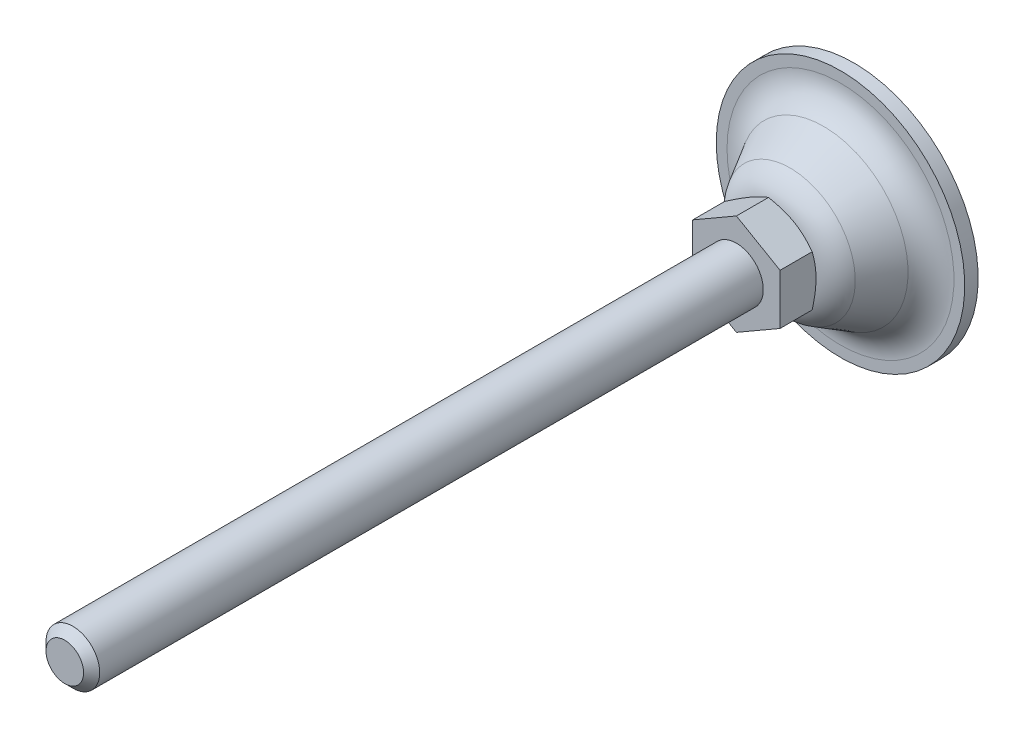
ISO-10303-21;
HEADER;
FILE_DESCRIPTION(('STEP AP214'),'2;1');
FILE_NAME('part.step','',(''),(''),'','','');
FILE_SCHEMA(('AUTOMOTIVE_DESIGN { 1 0 10303 214 1 1 1 1 }'));
ENDSEC;
DATA;
#1=APPLICATION_CONTEXT('core data for automotive mechanical design processes');
#2=APPLICATION_PROTOCOL_DEFINITION('international standard','automotive_design',2000,#1);
#3=PRODUCT_CONTEXT('',#1,'mechanical');
#4=PRODUCT('Part','Part','',(#3));
#5=PRODUCT_RELATED_PRODUCT_CATEGORY('part','',(#4));
#6=PRODUCT_DEFINITION_FORMATION('','',#4);
#7=PRODUCT_DEFINITION_CONTEXT('part definition',#1,'design');
#8=PRODUCT_DEFINITION('design','',#6,#7);
#9=PRODUCT_DEFINITION_SHAPE('','',#8);
#10=(LENGTH_UNIT() NAMED_UNIT(*) SI_UNIT(.MILLI.,.METRE.));
#11=(NAMED_UNIT(*) PLANE_ANGLE_UNIT() SI_UNIT($,.RADIAN.));
#12=(NAMED_UNIT(*) SI_UNIT($,.STERADIAN.) SOLID_ANGLE_UNIT());
#13=UNCERTAINTY_MEASURE_WITH_UNIT(LENGTH_MEASURE(1.E-05),#10,'distance_accuracy_value','');
#14=(GEOMETRIC_REPRESENTATION_CONTEXT(3) GLOBAL_UNCERTAINTY_ASSIGNED_CONTEXT((#13)) GLOBAL_UNIT_ASSIGNED_CONTEXT((#10,
#11,#12)) REPRESENTATION_CONTEXT('',''));
#15=CARTESIAN_POINT('',(0.,0.,0.));
#16=DIRECTION('',(0.,0.,1.));
#17=DIRECTION('',(1.,0.,0.));
#18=AXIS2_PLACEMENT_3D('',#15,#16,#17);
#19=CARTESIAN_POINT('',(-9.25,16.0214699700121,1.9999991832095));
#20=DIRECTION('',(0.,0.,-1.));
#21=DIRECTION('',(-0.5,0.86602540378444,0.));
#22=AXIS2_PLACEMENT_3D('',#19,#20,#21);
#23=PLANE('',#22);
#24=CARTESIAN_POINT('',(0.,0.,1.9999991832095));
#25=DIRECTION('',(0.,0.,1.));
#26=DIRECTION('',(0.5,-0.86602540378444,0.));
#27=AXIS2_PLACEMENT_3D('',#24,#25,#26);
#28=CIRCLE('',#27,16.8976413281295);
#29=CARTESIAN_POINT('',(8.44882066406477,-14.633786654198,1.9999991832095));
#30=VERTEX_POINT('',#29);
#31=EDGE_CURVE('E108',#30,#30,#28,.T.);
#32=ORIENTED_EDGE('',*,*,#31,.F.);
#33=EDGE_LOOP('',(#32));
#34=FACE_BOUND('',#33,.T.);
#35=CARTESIAN_POINT('',(0.,0.,2.));
#36=DIRECTION('',(0.,0.,-1.));
#37=DIRECTION('',(-1.,0.,0.));
#38=AXIS2_PLACEMENT_3D('',#35,#36,#37);
#39=CIRCLE('',#38,18.5);
#40=CARTESIAN_POINT('',(-18.5,0.,2.));
#41=VERTEX_POINT('',#40);
#42=EDGE_CURVE('E207',#41,#41,#39,.T.);
#43=ORIENTED_EDGE('',*,*,#42,.F.);
#44=EDGE_LOOP('',(#43));
#45=FACE_BOUND('',#44,.T.);
#46=ADVANCED_FACE('F14',(#34,#45),#23,.F.);
#47=CARTESIAN_POINT('',(0.,0.,17.5));
#48=DIRECTION('',(0.,0.,1.));
#49=DIRECTION('',(0.5,-0.86602540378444,0.));
#50=AXIS2_PLACEMENT_3D('',#47,#48,#49);
#51=PLANE('',#50);
#52=DIRECTION('',(0.,1.,0.));
#53=VECTOR('',#52,1.);
#54=CARTESIAN_POINT('',(6.5,-3.75277674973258,17.5));
#55=LINE('',#54,#53);
#56=CARTESIAN_POINT('',(6.5,-3.75277674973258,17.5));
#57=VERTEX_POINT('',#56);
#58=CARTESIAN_POINT('',(6.5,3.75277674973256,17.5));
#59=VERTEX_POINT('',#58);
#60=EDGE_CURVE('E371',#57,#59,#55,.T.);
#61=ORIENTED_EDGE('',*,*,#60,.T.);
#62=DIRECTION('',(-0.866025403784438,0.5,0.));
#63=VECTOR('',#62,1.);
#64=CARTESIAN_POINT('',(6.5,3.75277674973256,17.5));
#65=LINE('',#64,#63);
#66=CARTESIAN_POINT('',(0.,7.50555349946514,17.5));
#67=VERTEX_POINT('',#66);
#68=EDGE_CURVE('E368',#59,#67,#65,.T.);
#69=ORIENTED_EDGE('',*,*,#68,.T.);
#70=DIRECTION('',(-0.866025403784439,-0.5,0.));
#71=VECTOR('',#70,1.);
#72=CARTESIAN_POINT('',(0.,7.50555349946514,17.5));
#73=LINE('',#72,#71);
#74=CARTESIAN_POINT('',(-6.5,3.75277674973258,17.5));
#75=VERTEX_POINT('',#74);
#76=EDGE_CURVE('E367',#67,#75,#73,.T.);
#77=ORIENTED_EDGE('',*,*,#76,.T.);
#78=DIRECTION('',(0.,-1.,0.));
#79=VECTOR('',#78,1.);
#80=CARTESIAN_POINT('',(-6.5,3.75277674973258,17.5));
#81=LINE('',#80,#79);
#82=CARTESIAN_POINT('',(-6.5,-3.75277674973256,17.5));
#83=VERTEX_POINT('',#82);
#84=EDGE_CURVE('E375',#75,#83,#81,.T.);
#85=ORIENTED_EDGE('',*,*,#84,.T.);
#86=DIRECTION('',(0.866025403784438,-0.5,0.));
#87=VECTOR('',#86,1.);
#88=CARTESIAN_POINT('',(-6.5,-3.75277674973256,17.5));
#89=LINE('',#88,#87);
#90=CARTESIAN_POINT('',(0.,-7.50555349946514,17.5));
#91=VERTEX_POINT('',#90);
#92=EDGE_CURVE('E377',#83,#91,#89,.T.);
#93=ORIENTED_EDGE('',*,*,#92,.T.);
#94=DIRECTION('',(0.866025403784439,0.5,0.));
#95=VECTOR('',#94,1.);
#96=CARTESIAN_POINT('',(0.,-7.50555349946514,17.5));
#97=LINE('',#96,#95);
#98=EDGE_CURVE('E37',#91,#57,#97,.T.);
#99=ORIENTED_EDGE('',*,*,#98,.T.);
#100=EDGE_LOOP('',(#61,#69,#77,#85,#93,#99));
#101=FACE_BOUND('',#100,.T.);
#102=CARTESIAN_POINT('',(0.,0.,17.5));
#103=DIRECTION('',(0.,0.,1.));
#104=DIRECTION('',(0.5,-0.86602540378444,0.));
#105=AXIS2_PLACEMENT_3D('',#102,#103,#104);
#106=CIRCLE('',#105,4.);
#107=CARTESIAN_POINT('',(2.,-3.46410161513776,17.5));
#108=VERTEX_POINT('',#107);
#109=EDGE_CURVE('E212',#108,#108,#106,.T.);
#110=ORIENTED_EDGE('',*,*,#109,.F.);
#111=EDGE_LOOP('',(#110));
#112=FACE_BOUND('',#111,.T.);
#113=ADVANCED_FACE('F129',(#101,#112),#51,.T.);
#114=CARTESIAN_POINT('',(0.,0.,7.));
#115=DIRECTION('',(0.,0.,1.));
#116=DIRECTION('',(0.5,-0.86602540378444,0.));
#117=AXIS2_PLACEMENT_3D('',#114,#115,#116);
#118=TOROIDAL_SURFACE('',#117,5.36011171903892,5.);
#119=CARTESIAN_POINT('',(0.,0.,12.));
#120=DIRECTION('',(0.,0.,1.));
#121=DIRECTION('',(0.5,-0.86602540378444,0.));
#122=AXIS2_PLACEMENT_3D('',#119,#120,#121);
#123=CIRCLE('',#122,5.36011171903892);
#124=CARTESIAN_POINT('',(2.68005585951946,-4.64199291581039,12.));
#125=VERTEX_POINT('',#124);
#126=EDGE_CURVE('E73',#125,#125,#123,.T.);
#127=ORIENTED_EDGE('',*,*,#126,.F.);
#128=EDGE_LOOP('',(#127));
#129=FACE_BOUND('',#128,.T.);
#130=CARTESIAN_POINT('',(0.,0.,9.49382979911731));
#131=DIRECTION('',(0.,0.,1.));
#132=DIRECTION('',(0.5,-0.86602540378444,0.));
#133=AXIS2_PLACEMENT_3D('',#130,#131,#132);
#134=CIRCLE('',#133,9.69379524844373);
#135=CARTESIAN_POINT('',(4.84689762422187,-8.39507294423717,9.49382979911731));
#136=VERTEX_POINT('',#135);
#137=EDGE_CURVE('E102',#136,#136,#134,.T.);
#138=ORIENTED_EDGE('',*,*,#137,.T.);
#139=EDGE_LOOP('',(#138));
#140=FACE_BOUND('',#139,.T.);
#141=ADVANCED_FACE('F186',(#129,#140),#118,.T.);
#142=CARTESIAN_POINT('',(0.,0.,6.9999991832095));
#143=DIRECTION('',(0.,0.,1.));
#144=DIRECTION('',(0.5,-0.86602540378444,0.));
#145=AXIS2_PLACEMENT_3D('',#142,#143,#144);
#146=TOROIDAL_SURFACE('',#145,16.8976413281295,5.);
#147=CARTESIAN_POINT('',(0.,0.,4.50616938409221));
#148=DIRECTION('',(0.,0.,1.));
#149=DIRECTION('',(0.5,-0.86602540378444,0.));
#150=AXIS2_PLACEMENT_3D('',#147,#148,#149);
#151=CIRCLE('',#150,12.5639577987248);
#152=CARTESIAN_POINT('',(6.28197889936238,-10.8807066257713,4.50616938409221));
#153=VERTEX_POINT('',#152);
#154=EDGE_CURVE('E105',#153,#153,#151,.T.);
#155=ORIENTED_EDGE('',*,*,#154,.F.);
#156=EDGE_LOOP('',(#155));
#157=FACE_BOUND('',#156,.T.);
#158=ORIENTED_EDGE('',*,*,#31,.T.);
#159=EDGE_LOOP('',(#158));
#160=FACE_BOUND('',#159,.T.);
#161=ADVANCED_FACE('F182',(#157,#160),#146,.F.);
#162=CARTESIAN_POINT('',(0.,0.,4.50616938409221));
#163=DIRECTION('',(0.,0.,-1.));
#164=DIRECTION('',(-0.5,0.86602540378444,0.));
#165=AXIS2_PLACEMENT_3D('',#162,#163,#164);
#166=CONICAL_SURFACE('',#165,12.5639577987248,0.522174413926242);
#167=ORIENTED_EDGE('',*,*,#137,.F.);
#168=EDGE_LOOP('',(#167));
#169=FACE_BOUND('',#168,.T.);
#170=ORIENTED_EDGE('',*,*,#154,.T.);
#171=EDGE_LOOP('',(#170));
#172=FACE_BOUND('',#171,.T.);
#173=ADVANCED_FACE('F179',(#169,#172),#166,.T.);
#174=CARTESIAN_POINT('',(0.,0.,12.));
#175=DIRECTION('',(0.,0.,1.));
#176=DIRECTION('',(0.5,-0.86602540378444,0.));
#177=AXIS2_PLACEMENT_3D('',#174,#175,#176);
#178=PLANE('',#177);
#179=CARTESIAN_POINT('',(0.,0.,12.));
#180=DIRECTION('',(0.,0.,-1.));
#181=DIRECTION('',(-0.5,0.86602540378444,0.));
#182=AXIS2_PLACEMENT_3D('',#179,#180,#181);
#183=CIRCLE('',#182,6.25);
#184=CARTESIAN_POINT('',(-3.125,5.41265877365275,12.));
#185=VERTEX_POINT('',#184);
#186=EDGE_CURVE('E84',#185,#185,#183,.T.);
#187=ORIENTED_EDGE('',*,*,#186,.T.);
#188=EDGE_LOOP('',(#187));
#189=FACE_BOUND('',#188,.T.);
#190=ORIENTED_EDGE('',*,*,#126,.T.);
#191=EDGE_LOOP('',(#190));
#192=FACE_BOUND('',#191,.T.);
#193=ADVANCED_FACE('F125',(#189,#192),#178,.F.);
#194=CARTESIAN_POINT('',(0.,0.,13.5200682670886));
#195=DIRECTION('',(0.,0.,1.));
#196=DIRECTION('',(0.5,-0.86602540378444,0.));
#197=AXIS2_PLACEMENT_3D('',#194,#195,#196);
#198=CONICAL_SURFACE('',#197,8.88283546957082,1.0471975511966);
#199=ORIENTED_EDGE('',*,*,#186,.F.);
#200=EDGE_LOOP('',(#199));
#201=FACE_BOUND('',#200,.T.);
#202=CARTESIAN_POINT('',(-5.44790297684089,-10.6509017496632,15.298594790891));
#203=CARTESIAN_POINT('',(-5.20230548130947,-10.5091059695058,15.1611764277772));
#204=CARTESIAN_POINT('',(-4.956140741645,-10.3669826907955,15.0250864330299));
#205=CARTESIAN_POINT('',(-4.46237499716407,-10.0819069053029,14.7563110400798));
#206=CARTESIAN_POINT('',(-4.21477377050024,-9.93895427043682,14.6236261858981));
#207=CARTESIAN_POINT('',(-3.71654215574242,-9.65130011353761,14.3617334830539));
#208=CARTESIAN_POINT('',(-3.46590259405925,-9.50659329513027,14.2325488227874));
#209=CARTESIAN_POINT('',(-2.96261869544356,-9.21602220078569,13.9795158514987));
#210=CARTESIAN_POINT('',(-2.70997445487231,-9.07015798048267,13.8556672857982));
#211=CARTESIAN_POINT('',(-2.19425176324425,-8.77240534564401,13.6109066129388));
#212=CARTESIAN_POINT('',(-1.93109585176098,-8.62047220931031,13.4902109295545));
#213=CARTESIAN_POINT('',(-1.40169322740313,-8.31482146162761,13.2580441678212));
#214=CARTESIAN_POINT('',(-1.13544616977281,-8.16110365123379,13.1465741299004));
#215=CARTESIAN_POINT('',(-0.599947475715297,-7.851933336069,12.93581171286));
#216=CARTESIAN_POINT('',(-0.330703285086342,-7.69648513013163,12.8364943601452));
#217=CARTESIAN_POINT('',(0.211649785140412,-7.38335743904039,12.6532497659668));
#218=CARTESIAN_POINT('',(0.484757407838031,-7.22567867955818,12.569317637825));
#219=CARTESIAN_POINT('',(1.03347068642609,-6.90887892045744,12.4213357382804));
#220=CARTESIAN_POINT('',(1.30905448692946,-6.74977053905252,12.3571796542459));
#221=CARTESIAN_POINT('',(1.86365420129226,-6.42957224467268,12.2524174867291));
#222=CARTESIAN_POINT('',(2.14266979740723,-6.2684825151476,12.2118092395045));
#223=CARTESIAN_POINT('',(2.56080401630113,-6.0270726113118,12.1712550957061));
#224=CARTESIAN_POINT('',(2.69921737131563,-5.94715962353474,12.1611313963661));
#225=CARTESIAN_POINT('',(2.9762968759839,-5.78718769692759,12.1476434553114));
#226=CARTESIAN_POINT('',(3.11496302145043,-5.707128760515,12.1442791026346));
#227=CARTESIAN_POINT('',(3.39229296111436,-5.54701224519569,12.1443975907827));
#228=CARTESIAN_POINT('',(3.53095675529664,-5.46695466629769,12.1478804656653));
#229=CARTESIAN_POINT('',(3.80803537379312,-5.30698325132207,12.1616069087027));
#230=CARTESIAN_POINT('',(3.94645018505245,-5.22706942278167,12.17185082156));
#231=CARTESIAN_POINT('',(4.28007777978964,-5.03444944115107,12.2044757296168));
#232=CARTESIAN_POINT('',(4.47505560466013,-4.92187894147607,12.2301273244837));
#233=CARTESIAN_POINT('',(4.86353391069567,-4.69759088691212,12.2934390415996));
#234=CARTESIAN_POINT('',(5.05703418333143,-4.5858734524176,12.3311008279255));
#235=CARTESIAN_POINT('',(5.63511426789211,-4.25211875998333,12.4601015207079));
#236=CARTESIAN_POINT('',(6.01705147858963,-4.03160720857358,12.5674312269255));
#237=CARTESIAN_POINT('',(6.58811023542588,-3.70190628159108,12.7531116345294));
#238=CARTESIAN_POINT('',(6.78020331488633,-3.59100129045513,12.8199741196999));
#239=CARTESIAN_POINT('',(7.16252306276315,-3.37026888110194,12.9605341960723));
#240=CARTESIAN_POINT('',(7.35274971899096,-3.26044146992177,13.0342318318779));
#241=CARTESIAN_POINT('',(7.73139832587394,-3.0418285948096,13.1872888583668));
#242=CARTESIAN_POINT('',(7.91982086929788,-2.9330427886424,13.2666463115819));
#243=CARTESIAN_POINT('',(8.29511118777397,-2.71636882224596,13.4301001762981));
#244=CARTESIAN_POINT('',(8.48197897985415,-2.6084806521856,13.514196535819));
#245=CARTESIAN_POINT('',(8.91814267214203,-2.35666142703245,13.7158388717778));
#246=CARTESIAN_POINT('',(9.16688725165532,-2.213048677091,13.8349718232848));
#247=CARTESIAN_POINT('',(9.66230392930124,-1.92701972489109,14.0788671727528));
#248=CARTESIAN_POINT('',(9.90897590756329,-1.78460359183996,14.2036298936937));
#249=CARTESIAN_POINT('',(10.4006223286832,-1.50075139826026,14.4576697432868));
#250=CARTESIAN_POINT('',(10.6455964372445,-1.35931553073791,14.5869477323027));
#251=CARTESIAN_POINT('',(11.1340885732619,-1.07728446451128,14.8491274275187));
#252=CARTESIAN_POINT('',(11.3776065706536,-0.936689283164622,14.9820292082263));
#253=CARTESIAN_POINT('',(11.8636665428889,-0.656062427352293,15.2509206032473));
#254=CARTESIAN_POINT('',(12.1062072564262,-0.51603148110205,15.3869132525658));
#255=CARTESIAN_POINT('',(12.5902533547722,-0.236567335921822,15.6613356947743));
#256=CARTESIAN_POINT('',(12.8317587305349,-0.0971341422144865,15.7997655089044));
#257=CARTESIAN_POINT('',(13.5549050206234,0.320374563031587,16.2180352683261));
#258=CARTESIAN_POINT('',(14.0352379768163,0.597694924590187,16.5008900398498));
#259=CARTESIAN_POINT('',(14.9539821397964,1.12813211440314,17.0487944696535));
#260=CARTESIAN_POINT('',(15.3925942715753,1.38136494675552,17.3133968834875));
#261=CARTESIAN_POINT('',(16.2681858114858,1.88688795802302,17.8462176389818));
#262=CARTESIAN_POINT('',(16.7051651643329,2.13917810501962,18.1144361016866));
#263=CARTESIAN_POINT('',(17.5767965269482,2.64241470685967,18.652983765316));
#264=CARTESIAN_POINT('',(18.0114516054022,2.89336293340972,18.9233063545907));
#265=CARTESIAN_POINT('',(18.8797150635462,3.39465507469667,19.4661210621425));
#266=CARTESIAN_POINT('',(19.3133234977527,3.64499902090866,19.7386130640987));
#267=CARTESIAN_POINT('',(19.7465453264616,3.89511976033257,20.0119166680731));
#268=B_SPLINE_CURVE_WITH_KNOTS('',3,(#202,#203,#204,#205,#206,#207,#208,#209,#210,#211,#212,
#213,#214,#215,#216,#217,#218,#219,#220,#221,#222,#223,#224,#225,#226,#227,#228,#229,#230,#231,
#232,#233,#234,#235,#236,#237,#238,#239,#240,#241,#242,#243,#244,#245,#246,#247,#248,#249,#250,
#251,#252,#253,#254,#255,#256,#257,#258,#259,#260,#261,#262,#263,#264,#265,#266,#267),
.UNSPECIFIED.,.F.,.F.,(4,2,2,2,2,2,2,2,2,2,2,2,2,2,2,2,2,2,2,2,2,2,2,2,2,2,2,2,2,2,2,2,4),(0.,
0.945406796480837,1.89096370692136,2.84173097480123,3.79245281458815,4.77321406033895,
5.75408576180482,6.73290667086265,7.71141614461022,8.68456969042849,9.65763380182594,
10.1379514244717,10.6182611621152,11.0985732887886,11.5789099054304,12.2583181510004,
12.9378205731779,14.2975940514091,14.9925427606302,15.6874960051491,16.3822124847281,
17.0769213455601,18.0096970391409,18.94252631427,19.875534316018,20.8085615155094,
21.7425482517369,22.6765431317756,24.5442948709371,26.2585421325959,27.9728469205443,
29.6830369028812,31.393135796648),.UNSPECIFIED.);
#269=CARTESIAN_POINT('',(0.,-7.50555349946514,12.7248941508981));
#270=VERTEX_POINT('',#269);
#271=CARTESIAN_POINT('',(6.5,-3.75277674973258,12.7248941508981));
#272=VERTEX_POINT('',#271);
#273=EDGE_CURVE('E65',#270,#272,#268,.T.);
#274=ORIENTED_EDGE('',*,*,#273,.F.);
#275=CARTESIAN_POINT('',(-6.5002,-3.75266127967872,12.7249608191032));
#276=CARTESIAN_POINT('',(-6.35732254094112,-3.8351516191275,12.6773419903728));
#277=CARTESIAN_POINT('',(-6.21391236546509,-3.91794952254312,12.6318842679));
#278=CARTESIAN_POINT('',(-5.92592736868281,-4.08421773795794,12.5458862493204));
#279=CARTESIAN_POINT('',(-5.78135207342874,-4.16768832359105,12.5053480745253));
#280=CARTESIAN_POINT('',(-5.34531134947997,-4.41943655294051,12.3919085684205));
#281=CARTESIAN_POINT('',(-5.05212471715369,-4.58870793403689,12.327385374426));
#282=CARTESIAN_POINT('',(-4.61337625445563,-4.84201947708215,12.2517241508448));
#283=CARTESIAN_POINT('',(-4.46912536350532,-4.92530276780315,12.2301704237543));
#284=CARTESIAN_POINT('',(-4.17997178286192,-5.09224566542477,12.1940278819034));
#285=CARTESIAN_POINT('',(-4.03506915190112,-5.17590523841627,12.179438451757));
#286=CARTESIAN_POINT('',(-3.74501222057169,-5.34336968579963,12.1575963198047));
#287=CARTESIAN_POINT('',(-3.5998583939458,-5.42717428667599,12.1503352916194));
#288=CARTESIAN_POINT('',(-3.30942466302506,-5.59485627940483,12.1432978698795));
#289=CARTESIAN_POINT('',(-3.16414476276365,-5.6787336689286,12.1435212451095));
#290=CARTESIAN_POINT('',(-2.76612405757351,-5.90853103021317,12.1544210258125));
#291=CARTESIAN_POINT('',(-2.51351353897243,-6.05437578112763,12.1727193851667));
#292=CARTESIAN_POINT('',(-2.00997032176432,-6.34509659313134,12.230743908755));
#293=CARTESIAN_POINT('',(-1.75903939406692,-6.48997163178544,12.2704899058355));
#294=CARTESIAN_POINT('',(-1.25448277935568,-6.78127752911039,12.3698434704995));
#295=CARTESIAN_POINT('',(-1.00092075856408,-6.92767163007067,12.4298719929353));
#296=CARTESIAN_POINT('',(-0.497578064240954,-7.21827667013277,12.5661125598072));
#297=CARTESIAN_POINT('',(-0.247790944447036,-7.36249133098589,12.6422926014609));
#298=CARTESIAN_POINT('',(0.00019999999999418,-7.50566896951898,12.7249608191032));
#299=B_SPLINE_CURVE_WITH_KNOTS('',3,(#275,#276,#277,#278,#279,#280,#281,#282,#283,#284,#285,
#286,#287,#288,#289,#290,#291,#292,#293,#294,#295,#296,#297,#298),.UNSPECIFIED.,.F.,.F.,(4,2,2,
2,2,2,2,2,2,2,2,4),(0.,0.515105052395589,1.03043143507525,2.06322554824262,2.56697389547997,
3.07067772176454,3.57380860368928,4.07692394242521,4.95279354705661,5.82947446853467,
6.72559912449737,7.61996451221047),.UNSPECIFIED.);
#300=CARTESIAN_POINT('',(-6.5,-3.75277674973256,12.7248941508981));
#301=VERTEX_POINT('',#300);
#302=EDGE_CURVE('E68',#301,#270,#299,.T.);
#303=ORIENTED_EDGE('',*,*,#302,.F.);
#304=CARTESIAN_POINT('',(-6.5,3.75300768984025,12.7249608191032));
#305=CARTESIAN_POINT('',(-6.5,3.58802701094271,12.6773419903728));
#306=CARTESIAN_POINT('',(-6.5,3.42243120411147,12.6318842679));
#307=CARTESIAN_POINT('',(-6.5,3.08989477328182,12.5458862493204));
#308=CARTESIAN_POINT('',(-6.5,2.92295360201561,12.5053480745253));
#309=CARTESIAN_POINT('',(-6.5,2.41945714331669,12.3919085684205));
#310=CARTESIAN_POINT('',(-6.5,2.08091438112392,12.327385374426));
#311=CARTESIAN_POINT('',(-6.5,1.57429129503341,12.2517241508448));
#312=CARTESIAN_POINT('',(-6.5,1.40772471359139,12.2301704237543));
#313=CARTESIAN_POINT('',(-6.5,1.07383891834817,12.1940278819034));
#314=CARTESIAN_POINT('',(-6.5,0.906519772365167,12.179438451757));
#315=CARTESIAN_POINT('',(-6.5,0.571590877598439,12.1575963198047));
#316=CARTESIAN_POINT('',(-6.50000000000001,0.403981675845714,12.1503352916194));
#317=CARTESIAN_POINT('',(-6.5,0.0686176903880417,12.1432978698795));
#318=CARTESIAN_POINT('',(-6.5,-0.0991370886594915,12.1435212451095));
#319=CARTESIAN_POINT('',(-6.5,-0.558731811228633,12.1544210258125));
#320=CARTESIAN_POINT('',(-6.5,-0.85042131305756,12.1727193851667));
#321=CARTESIAN_POINT('',(-6.50000000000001,-1.43186293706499,12.230743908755));
#322=CARTESIAN_POINT('',(-6.50000000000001,-1.72161301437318,12.2704899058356));
#323=CARTESIAN_POINT('',(-6.50000000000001,-2.30422480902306,12.3698434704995));
#324=CARTESIAN_POINT('',(-6.50000000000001,-2.59701301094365,12.4298719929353));
#325=CARTESIAN_POINT('',(-6.50000000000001,-3.17822309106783,12.5661125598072));
#326=CARTESIAN_POINT('',(-6.50000000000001,-3.46665241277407,12.6422926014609));
#327=CARTESIAN_POINT('',(-6.5,-3.75300768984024,12.7249608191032));
#328=B_SPLINE_CURVE_WITH_KNOTS('',3,(#304,#305,#306,#307,#308,#309,#310,#311,#312,#313,#314,
#315,#316,#317,#318,#319,#320,#321,#322,#323,#324,#325,#326,#327),.UNSPECIFIED.,.F.,.F.,(4,2,2,
2,2,2,2,2,2,2,2,4),(0.,0.51510505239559,1.03043143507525,2.06322554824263,2.56697389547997,
3.07067772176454,3.57380860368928,4.07692394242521,4.95279354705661,5.82947446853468,
6.72559912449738,7.61996451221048),.UNSPECIFIED.);
#329=CARTESIAN_POINT('',(-6.5,3.75277674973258,12.7248941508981));
#330=VERTEX_POINT('',#329);
#331=EDGE_CURVE('E83',#330,#301,#328,.T.);
#332=ORIENTED_EDGE('',*,*,#331,.F.);
#333=CARTESIAN_POINT('',(-11.9479029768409,0.607428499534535,15.298594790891));
#334=CARTESIAN_POINT('',(-11.7023054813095,0.749224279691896,15.1611764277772));
#335=CARTESIAN_POINT('',(-11.456140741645,0.891347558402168,15.0250864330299));
#336=CARTESIAN_POINT('',(-10.9623749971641,1.17642334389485,14.7563110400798));
#337=CARTESIAN_POINT('',(-10.7147737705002,1.31937597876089,14.6236261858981));
#338=CARTESIAN_POINT('',(-10.2165421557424,1.6070301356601,14.3617334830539));
#339=CARTESIAN_POINT('',(-9.96590259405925,1.75173695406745,14.2325488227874));
#340=CARTESIAN_POINT('',(-9.46261869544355,2.04230804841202,13.9795158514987));
#341=CARTESIAN_POINT('',(-9.2099744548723,2.18817226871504,13.8556672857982));
#342=CARTESIAN_POINT('',(-8.69425176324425,2.4859249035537,13.6109066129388));
#343=CARTESIAN_POINT('',(-8.43109585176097,2.63785803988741,13.4902109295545));
#344=CARTESIAN_POINT('',(-7.90169322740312,2.94350878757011,13.2580441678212));
#345=CARTESIAN_POINT('',(-7.6354461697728,3.09722659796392,13.1465741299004));
#346=CARTESIAN_POINT('',(-7.09994747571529,3.40639691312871,12.93581171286));
#347=CARTESIAN_POINT('',(-6.83070328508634,3.56184511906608,12.8364943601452));
#348=CARTESIAN_POINT('',(-6.28835021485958,3.87497281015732,12.6532497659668));
#349=CARTESIAN_POINT('',(-6.01524259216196,4.03265156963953,12.569317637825));
#350=CARTESIAN_POINT('',(-5.4665293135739,4.34945132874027,12.4213357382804));
#351=CARTESIAN_POINT('',(-5.19094551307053,4.50855971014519,12.3571796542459));
#352=CARTESIAN_POINT('',(-4.63634579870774,4.82875800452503,12.2524174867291));
#353=CARTESIAN_POINT('',(-4.35733020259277,4.98984773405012,12.2118092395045));
#354=CARTESIAN_POINT('',(-3.93919598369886,5.23125763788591,12.1712550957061));
#355=CARTESIAN_POINT('',(-3.80078262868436,5.31117062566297,12.1611313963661));
#356=CARTESIAN_POINT('',(-3.52370312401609,5.47114255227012,12.1476434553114));
#357=CARTESIAN_POINT('',(-3.38503697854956,5.55120148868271,12.1442791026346));
#358=CARTESIAN_POINT('',(-3.10770703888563,5.71131800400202,12.1443975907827));
#359=CARTESIAN_POINT('',(-2.96904324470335,5.79137558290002,12.1478804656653));
#360=CARTESIAN_POINT('',(-2.69196462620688,5.95134699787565,12.1616069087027));
#361=CARTESIAN_POINT('',(-2.55354981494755,6.03126082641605,12.17185082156));
#362=CARTESIAN_POINT('',(-2.21992222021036,6.22388080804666,12.2044757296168));
#363=CARTESIAN_POINT('',(-2.02494439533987,6.33645130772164,12.2301273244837));
#364=CARTESIAN_POINT('',(-1.63646608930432,6.56073936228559,12.2934390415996));
#365=CARTESIAN_POINT('',(-1.44296581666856,6.67245679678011,12.3311008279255));
#366=CARTESIAN_POINT('',(-0.864885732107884,7.00621148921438,12.4601015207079));
#367=CARTESIAN_POINT('',(-0.482948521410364,7.22672304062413,12.5674312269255));
#368=CARTESIAN_POINT('',(0.0881102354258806,7.55642396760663,12.7531116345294));
#369=CARTESIAN_POINT('',(0.280203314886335,7.66732895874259,12.8199741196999));
#370=CARTESIAN_POINT('',(0.662523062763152,7.88806136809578,12.9605341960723));
#371=CARTESIAN_POINT('',(0.852749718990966,7.99788877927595,13.0342318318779));
#372=CARTESIAN_POINT('',(1.23139832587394,8.21650165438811,13.1872888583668));
#373=CARTESIAN_POINT('',(1.41982086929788,8.32528746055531,13.2666463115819));
#374=CARTESIAN_POINT('',(1.79511118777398,8.54196142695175,13.4301001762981));
#375=CARTESIAN_POINT('',(1.98197897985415,8.64984959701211,13.514196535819));
#376=CARTESIAN_POINT('',(2.41814267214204,8.90166882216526,13.7158388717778));
#377=CARTESIAN_POINT('',(2.66688725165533,9.04528157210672,13.8349718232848));
#378=CARTESIAN_POINT('',(3.16230392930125,9.33131052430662,14.0788671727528));
#379=CARTESIAN_POINT('',(3.4089759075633,9.47372665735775,14.2036298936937));
#380=CARTESIAN_POINT('',(3.90062232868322,9.75757885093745,14.4576697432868));
#381=CARTESIAN_POINT('',(4.14559643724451,9.8990147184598,14.5869477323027));
#382=CARTESIAN_POINT('',(4.63408857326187,10.1810457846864,14.8491274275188));
#383=CARTESIAN_POINT('',(4.87760657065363,10.3216409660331,14.9820292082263));
#384=CARTESIAN_POINT('',(5.36366654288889,10.6022678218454,15.2509206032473));
#385=CARTESIAN_POINT('',(5.60620725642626,10.7422987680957,15.3869132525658));
#386=CARTESIAN_POINT('',(6.09025335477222,11.0217629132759,15.6613356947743));
#387=CARTESIAN_POINT('',(6.33175873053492,11.1611961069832,15.7997655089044));
#388=CARTESIAN_POINT('',(7.05490502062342,11.5787048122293,16.2180352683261));
#389=CARTESIAN_POINT('',(7.53523797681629,11.8560251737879,16.5008900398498));
#390=CARTESIAN_POINT('',(8.45398213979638,12.3864623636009,17.0487944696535));
#391=CARTESIAN_POINT('',(8.89259427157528,12.6396951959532,17.3133968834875));
#392=CARTESIAN_POINT('',(9.76818581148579,13.1452182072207,17.8462176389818));
#393=CARTESIAN_POINT('',(10.2051651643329,13.3975083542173,18.1144361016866));
#394=CARTESIAN_POINT('',(11.0767965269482,13.9007449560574,18.652983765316));
#395=CARTESIAN_POINT('',(11.5114516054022,14.1516931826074,18.9233063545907));
#396=CARTESIAN_POINT('',(12.3797150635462,14.6529853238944,19.4661210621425));
#397=CARTESIAN_POINT('',(12.8133234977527,14.9033292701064,19.7386130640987));
#398=CARTESIAN_POINT('',(13.2465453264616,15.1534500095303,20.0119166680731));
#399=B_SPLINE_CURVE_WITH_KNOTS('',3,(#333,#334,#335,#336,#337,#338,#339,#340,#341,#342,#343,
#344,#345,#346,#347,#348,#349,#350,#351,#352,#353,#354,#355,#356,#357,#358,#359,#360,#361,#362,
#363,#364,#365,#366,#367,#368,#369,#370,#371,#372,#373,#374,#375,#376,#377,#378,#379,#380,#381,
#382,#383,#384,#385,#386,#387,#388,#389,#390,#391,#392,#393,#394,#395,#396,#397,#398),
.UNSPECIFIED.,.F.,.F.,(4,2,2,2,2,2,2,2,2,2,2,2,2,2,2,2,2,2,2,2,2,2,2,2,2,2,2,2,2,2,2,2,4),(0.,
0.945406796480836,1.89096370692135,2.84173097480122,3.79245281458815,4.77321406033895,
5.75408576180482,6.73290667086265,7.71141614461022,8.68456969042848,9.65763380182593,
10.1379514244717,10.6182611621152,11.0985732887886,11.5789099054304,12.2583181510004,
12.9378205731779,14.2975940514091,14.9925427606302,15.6874960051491,16.3822124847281,
17.0769213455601,18.0096970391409,18.94252631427,19.875534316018,20.8085615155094,
21.7425482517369,22.6765431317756,24.5442948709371,26.2585421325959,27.9728469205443,
29.6830369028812,31.393135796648),.UNSPECIFIED.);
#400=CARTESIAN_POINT('',(0.,7.50555349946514,12.7248941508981));
#401=VERTEX_POINT('',#400);
#402=EDGE_CURVE('E148',#401,#330,#399,.F.);
#403=ORIENTED_EDGE('',*,*,#402,.F.);
#404=CARTESIAN_POINT('',(6.5002,3.75266127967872,12.7249608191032));
#405=CARTESIAN_POINT('',(6.35732254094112,3.8351516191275,12.6773419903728));
#406=CARTESIAN_POINT('',(6.21391236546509,3.91794952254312,12.6318842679));
#407=CARTESIAN_POINT('',(5.92592736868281,4.08421773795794,12.5458862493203));
#408=CARTESIAN_POINT('',(5.78135207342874,4.16768832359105,12.5053480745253));
#409=CARTESIAN_POINT('',(5.34531134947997,4.41943655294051,12.3919085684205));
#410=CARTESIAN_POINT('',(5.05212471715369,4.58870793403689,12.327385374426));
#411=CARTESIAN_POINT('',(4.61337625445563,4.84201947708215,12.2517241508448));
#412=CARTESIAN_POINT('',(4.46912536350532,4.92530276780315,12.2301704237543));
#413=CARTESIAN_POINT('',(4.17997178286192,5.09224566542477,12.1940278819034));
#414=CARTESIAN_POINT('',(4.03506915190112,5.17590523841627,12.179438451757));
#415=CARTESIAN_POINT('',(3.74501222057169,5.34336968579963,12.1575963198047));
#416=CARTESIAN_POINT('',(3.5998583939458,5.42717428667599,12.1503352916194));
#417=CARTESIAN_POINT('',(3.30942466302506,5.59485627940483,12.1432978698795));
#418=CARTESIAN_POINT('',(3.16414476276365,5.6787336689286,12.1435212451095));
#419=CARTESIAN_POINT('',(2.76612405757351,5.90853103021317,12.1544210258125));
#420=CARTESIAN_POINT('',(2.51351353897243,6.05437578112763,12.1727193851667));
#421=CARTESIAN_POINT('',(2.00997032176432,6.34509659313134,12.230743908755));
#422=CARTESIAN_POINT('',(1.75903939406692,6.48997163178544,12.2704899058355));
#423=CARTESIAN_POINT('',(1.25448277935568,6.78127752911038,12.3698434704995));
#424=CARTESIAN_POINT('',(1.00092075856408,6.92767163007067,12.4298719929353));
#425=CARTESIAN_POINT('',(0.497578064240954,7.21827667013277,12.5661125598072));
#426=CARTESIAN_POINT('',(0.247790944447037,7.36249133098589,12.6422926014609));
#427=CARTESIAN_POINT('',(-0.000199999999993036,7.50566896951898,12.7249608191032));
#428=B_SPLINE_CURVE_WITH_KNOTS('',3,(#404,#405,#406,#407,#408,#409,#410,#411,#412,#413,#414,
#415,#416,#417,#418,#419,#420,#421,#422,#423,#424,#425,#426,#427),.UNSPECIFIED.,.F.,.F.,(4,2,2,
2,2,2,2,2,2,2,2,4),(0.,0.51510505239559,1.03043143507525,2.06322554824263,2.56697389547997,
3.07067772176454,3.57380860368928,4.07692394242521,4.95279354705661,5.82947446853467,
6.72559912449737,7.61996451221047),.UNSPECIFIED.);
#429=CARTESIAN_POINT('',(6.5,3.75277674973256,12.7248941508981));
#430=VERTEX_POINT('',#429);
#431=EDGE_CURVE('E155',#430,#401,#428,.T.);
#432=ORIENTED_EDGE('',*,*,#431,.F.);
#433=CARTESIAN_POINT('',(6.5,-3.75300768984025,12.7249608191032));
#434=CARTESIAN_POINT('',(6.5,-3.5880270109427,12.6773419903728));
#435=CARTESIAN_POINT('',(6.5,-3.42243120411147,12.6318842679));
#436=CARTESIAN_POINT('',(6.5,-3.08989477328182,12.5458862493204));
#437=CARTESIAN_POINT('',(6.5,-2.92295360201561,12.5053480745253));
#438=CARTESIAN_POINT('',(6.5,-2.41945714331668,12.3919085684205));
#439=CARTESIAN_POINT('',(6.5,-2.08091438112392,12.327385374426));
#440=CARTESIAN_POINT('',(6.5,-1.57429129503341,12.2517241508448));
#441=CARTESIAN_POINT('',(6.5,-1.40772471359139,12.2301704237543));
#442=CARTESIAN_POINT('',(6.5,-1.07383891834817,12.1940278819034));
#443=CARTESIAN_POINT('',(6.5,-0.906519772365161,12.179438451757));
#444=CARTESIAN_POINT('',(6.5,-0.571590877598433,12.1575963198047));
#445=CARTESIAN_POINT('',(6.50000000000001,-0.403981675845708,12.1503352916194));
#446=CARTESIAN_POINT('',(6.5,-0.0686176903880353,12.1432978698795));
#447=CARTESIAN_POINT('',(6.5,0.0991370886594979,12.1435212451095));
#448=CARTESIAN_POINT('',(6.5,0.558731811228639,12.1544210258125));
#449=CARTESIAN_POINT('',(6.5,0.850421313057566,12.1727193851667));
#450=CARTESIAN_POINT('',(6.50000000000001,1.43186293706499,12.230743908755));
#451=CARTESIAN_POINT('',(6.50000000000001,1.72161301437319,12.2704899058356));
#452=CARTESIAN_POINT('',(6.50000000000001,2.30422480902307,12.3698434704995));
#453=CARTESIAN_POINT('',(6.50000000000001,2.59701301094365,12.4298719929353));
#454=CARTESIAN_POINT('',(6.50000000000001,3.17822309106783,12.5661125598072));
#455=CARTESIAN_POINT('',(6.50000000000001,3.46665241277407,12.6422926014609));
#456=CARTESIAN_POINT('',(6.5,3.75300768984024,12.7249608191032));
#457=B_SPLINE_CURVE_WITH_KNOTS('',3,(#433,#434,#435,#436,#437,#438,#439,#440,#441,#442,#443,
#444,#445,#446,#447,#448,#449,#450,#451,#452,#453,#454,#455,#456),.UNSPECIFIED.,.F.,.F.,(4,2,2,
2,2,2,2,2,2,2,2,4),(0.,0.51510505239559,1.03043143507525,2.06322554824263,2.56697389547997,
3.07067772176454,3.57380860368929,4.07692394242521,4.95279354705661,5.82947446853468,
6.72559912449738,7.61996451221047),.UNSPECIFIED.);
#458=EDGE_CURVE('E29',#272,#430,#457,.T.);
#459=ORIENTED_EDGE('',*,*,#458,.F.);
#460=EDGE_LOOP('',(#274,#303,#332,#403,#432,#459));
#461=FACE_BOUND('',#460,.T.);
#462=ADVANCED_FACE('F67',(#201,#461),#198,.T.);
#463=CARTESIAN_POINT('',(0.,-7.50555349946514,17.5));
#464=DIRECTION('',(-0.5,0.86602540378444,0.));
#465=DIRECTION('',(-0.866025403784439,-0.5,0.));
#466=AXIS2_PLACEMENT_3D('',#463,#464,#465);
#467=PLANE('',#466);
#468=DIRECTION('',(0.,0.,-1.));
#469=VECTOR('',#468,1.);
#470=CARTESIAN_POINT('',(0.,-7.50555349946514,17.5));
#471=LINE('',#470,#469);
#472=EDGE_CURVE('E80',#91,#270,#471,.T.);
#473=ORIENTED_EDGE('',*,*,#472,.T.);
#474=ORIENTED_EDGE('',*,*,#273,.T.);
#475=DIRECTION('',(0.,0.,-1.));
#476=VECTOR('',#475,1.);
#477=CARTESIAN_POINT('',(6.5,-3.75277674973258,17.5));
#478=LINE('',#477,#476);
#479=EDGE_CURVE('E87',#57,#272,#478,.T.);
#480=ORIENTED_EDGE('',*,*,#479,.F.);
#481=ORIENTED_EDGE('',*,*,#98,.F.);
#482=EDGE_LOOP('',(#473,#474,#480,#481));
#483=FACE_BOUND('',#482,.T.);
#484=ADVANCED_FACE('F86',(#483),#467,.F.);
#485=CARTESIAN_POINT('',(-6.5,-3.75277674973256,17.5));
#486=DIRECTION('',(0.5,0.866025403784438,0.));
#487=DIRECTION('',(-0.866025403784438,0.5,0.));
#488=AXIS2_PLACEMENT_3D('',#485,#486,#487);
#489=PLANE('',#488);
#490=DIRECTION('',(0.,0.,-1.));
#491=VECTOR('',#490,1.);
#492=CARTESIAN_POINT('',(-6.5,-3.75277674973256,17.5));
#493=LINE('',#492,#491);
#494=EDGE_CURVE('E82',#83,#301,#493,.T.);
#495=ORIENTED_EDGE('',*,*,#494,.T.);
#496=ORIENTED_EDGE('',*,*,#302,.T.);
#497=ORIENTED_EDGE('',*,*,#472,.F.);
#498=ORIENTED_EDGE('',*,*,#92,.F.);
#499=EDGE_LOOP('',(#495,#496,#497,#498));
#500=FACE_BOUND('',#499,.T.);
#501=ADVANCED_FACE('F78',(#500),#489,.F.);
#502=CARTESIAN_POINT('',(-6.5,3.75277674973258,17.5));
#503=DIRECTION('',(1.,0.,0.));
#504=DIRECTION('',(0.,1.,0.));
#505=AXIS2_PLACEMENT_3D('',#502,#503,#504);
#506=PLANE('',#505);
#507=DIRECTION('',(0.,0.,-1.));
#508=VECTOR('',#507,1.);
#509=CARTESIAN_POINT('',(-6.5,3.75277674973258,17.5));
#510=LINE('',#509,#508);
#511=EDGE_CURVE('E89',#75,#330,#510,.T.);
#512=ORIENTED_EDGE('',*,*,#511,.T.);
#513=ORIENTED_EDGE('',*,*,#331,.T.);
#514=ORIENTED_EDGE('',*,*,#494,.F.);
#515=ORIENTED_EDGE('',*,*,#84,.F.);
#516=EDGE_LOOP('',(#512,#513,#514,#515));
#517=FACE_BOUND('',#516,.T.);
#518=ADVANCED_FACE('F250',(#517),#506,.F.);
#519=CARTESIAN_POINT('',(0.,7.50555349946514,17.5));
#520=DIRECTION('',(0.5,-0.86602540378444,0.));
#521=DIRECTION('',(0.866025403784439,0.5,0.));
#522=AXIS2_PLACEMENT_3D('',#519,#520,#521);
#523=PLANE('',#522);
#524=DIRECTION('',(0.,0.,-1.));
#525=VECTOR('',#524,1.);
#526=CARTESIAN_POINT('',(0.,7.50555349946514,17.5));
#527=LINE('',#526,#525);
#528=EDGE_CURVE('E96',#67,#401,#527,.T.);
#529=ORIENTED_EDGE('',*,*,#528,.T.);
#530=ORIENTED_EDGE('',*,*,#402,.T.);
#531=ORIENTED_EDGE('',*,*,#511,.F.);
#532=ORIENTED_EDGE('',*,*,#76,.F.);
#533=EDGE_LOOP('',(#529,#530,#531,#532));
#534=FACE_BOUND('',#533,.T.);
#535=ADVANCED_FACE('F172',(#534),#523,.F.);
#536=CARTESIAN_POINT('',(6.5,3.75277674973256,17.5));
#537=DIRECTION('',(-0.5,-0.866025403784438,0.));
#538=DIRECTION('',(0.866025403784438,-0.5,0.));
#539=AXIS2_PLACEMENT_3D('',#536,#537,#538);
#540=PLANE('',#539);
#541=DIRECTION('',(0.,0.,-1.));
#542=VECTOR('',#541,1.);
#543=CARTESIAN_POINT('',(6.5,3.75277674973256,17.5));
#544=LINE('',#543,#542);
#545=EDGE_CURVE('E99',#59,#430,#544,.T.);
#546=ORIENTED_EDGE('',*,*,#545,.T.);
#547=ORIENTED_EDGE('',*,*,#431,.T.);
#548=ORIENTED_EDGE('',*,*,#528,.F.);
#549=ORIENTED_EDGE('',*,*,#68,.F.);
#550=EDGE_LOOP('',(#546,#547,#548,#549));
#551=FACE_BOUND('',#550,.T.);
#552=ADVANCED_FACE('F168',(#551),#540,.F.);
#553=CARTESIAN_POINT('',(6.5,-3.75277674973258,17.5));
#554=DIRECTION('',(-1.,0.,0.));
#555=DIRECTION('',(0.,-1.,0.));
#556=AXIS2_PLACEMENT_3D('',#553,#554,#555);
#557=PLANE('',#556);
#558=ORIENTED_EDGE('',*,*,#479,.T.);
#559=ORIENTED_EDGE('',*,*,#458,.T.);
#560=ORIENTED_EDGE('',*,*,#545,.F.);
#561=ORIENTED_EDGE('',*,*,#60,.F.);
#562=EDGE_LOOP('',(#558,#559,#560,#561));
#563=FACE_BOUND('',#562,.T.);
#564=ADVANCED_FACE('F171',(#563),#557,.F.);
#565=CARTESIAN_POINT('',(0.,0.,67.5));
#566=DIRECTION('',(0.,0.,-1.));
#567=DIRECTION('',(-0.5,0.86602540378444,0.));
#568=AXIS2_PLACEMENT_3D('',#565,#566,#567);
#569=CYLINDRICAL_SURFACE('',#568,4.);
#570=CARTESIAN_POINT('',(0.,0.,116.3));
#571=DIRECTION('',(0.,0.,1.));
#572=DIRECTION('',(0.,-1.,0.));
#573=AXIS2_PLACEMENT_3D('',#570,#571,#572);
#574=CIRCLE('',#573,4.);
#575=CARTESIAN_POINT('',(0.,-4.,116.3));
#576=VERTEX_POINT('',#575);
#577=EDGE_CURVE('E9',#576,#576,#574,.F.);
#578=ORIENTED_EDGE('',*,*,#577,.T.);
#579=EDGE_LOOP('',(#578));
#580=FACE_BOUND('',#579,.T.);
#581=ORIENTED_EDGE('',*,*,#109,.T.);
#582=EDGE_LOOP('',(#581));
#583=FACE_BOUND('',#582,.T.);
#584=ADVANCED_FACE('F127',(#580,#583),#569,.T.);
#585=CARTESIAN_POINT('',(0.,0.,-6.338279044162));
#586=DIRECTION('',(0.,0.,-1.));
#587=DIRECTION('',(-1.,0.,0.));
#588=AXIS2_PLACEMENT_3D('',#585,#586,#587);
#589=CYLINDRICAL_SURFACE('',#588,18.5);
#590=ORIENTED_EDGE('',*,*,#42,.T.);
#591=EDGE_LOOP('',(#590));
#592=FACE_BOUND('',#591,.T.);
#593=CARTESIAN_POINT('',(0.,0.,0.));
#594=DIRECTION('',(0.,0.,-1.));
#595=DIRECTION('',(-1.,0.,0.));
#596=AXIS2_PLACEMENT_3D('',#593,#594,#595);
#597=CIRCLE('',#596,18.5);
#598=CARTESIAN_POINT('',(-18.5,0.,0.));
#599=VERTEX_POINT('',#598);
#600=EDGE_CURVE('E209',#599,#599,#597,.T.);
#601=ORIENTED_EDGE('',*,*,#600,.F.);
#602=EDGE_LOOP('',(#601));
#603=FACE_BOUND('',#602,.T.);
#604=ADVANCED_FACE('F280',(#592,#603),#589,.T.);
#605=CARTESIAN_POINT('',(-27.,25.0446460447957,0.));
#606=DIRECTION('',(0.,0.,1.));
#607=DIRECTION('',(1.,0.,0.));
#608=AXIS2_PLACEMENT_3D('',#605,#606,#607);
#609=PLANE('',#608);
#610=ORIENTED_EDGE('',*,*,#600,.T.);
#611=EDGE_LOOP('',(#610));
#612=FACE_BOUND('',#611,.T.);
#613=ADVANCED_FACE('F288',(#612),#609,.F.);
#614=CARTESIAN_POINT('',(0.,0.,117.5));
#615=DIRECTION('',(0.,0.,1.));
#616=DIRECTION('',(1.,0.,0.));
#617=AXIS2_PLACEMENT_3D('',#614,#615,#616);
#618=PLANE('',#617);
#619=CARTESIAN_POINT('',(0.,0.,117.5));
#620=DIRECTION('',(0.,0.,1.));
#621=DIRECTION('',(1.,0.,0.));
#622=AXIS2_PLACEMENT_3D('',#619,#620,#621);
#623=CIRCLE('',#622,2.8);
#624=CARTESIAN_POINT('',(2.8,0.,117.5));
#625=VERTEX_POINT('',#624);
#626=EDGE_CURVE('E22',#625,#625,#623,.T.);
#627=ORIENTED_EDGE('',*,*,#626,.T.);
#628=EDGE_LOOP('',(#627));
#629=FACE_BOUND('',#628,.T.);
#630=ADVANCED_FACE('F296',(#629),#618,.T.);
#631=CARTESIAN_POINT('',(0.,0.,117.5));
#632=DIRECTION('',(0.,0.,-1.));
#633=DIRECTION('',(0.,1.,0.));
#634=AXIS2_PLACEMENT_3D('',#631,#632,#633);
#635=CONICAL_SURFACE('',#634,2.8,0.785398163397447);
#636=ORIENTED_EDGE('',*,*,#577,.F.);
#637=EDGE_LOOP('',(#636));
#638=FACE_BOUND('',#637,.T.);
#639=ORIENTED_EDGE('',*,*,#626,.F.);
#640=EDGE_LOOP('',(#639));
#641=FACE_BOUND('',#640,.T.);
#642=ADVANCED_FACE('F16',(#638,#641),#635,.T.);
#643=CLOSED_SHELL('',(#46,#113,#141,#161,#173,#193,#462,#484,#501,#518,#535,#552,#564,#584,#604,
#613,#630,#642));
#644=MANIFOLD_SOLID_BREP('B1',#643);
#645=ADVANCED_BREP_SHAPE_REPRESENTATION('',(#18,#644),#14);
#646=SHAPE_DEFINITION_REPRESENTATION(#9,#645);
ENDSEC;
END-ISO-10303-21;
